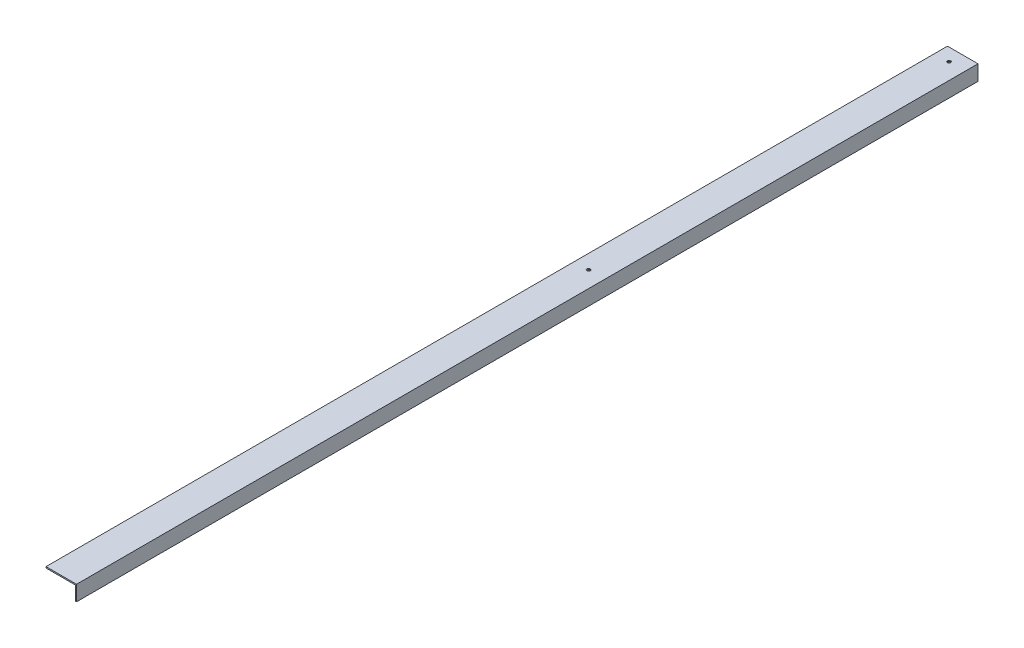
from build123d import *

# Parameters (mm, degrees)
EXTRUDE_THIN1_DEPTH            = 1125.4359
F_4_CLEARANCE_HOLE1_AT_2_COUNT = 2
F_4_CLEARANCE_HOLE1_AT_2_PITCH = 450


with BuildPart() as part:
    # Sketch1 → Extrude-Thin1 (new body)
    with BuildSketch(Plane.XY):
        Polygon((-38.1, 0), (0, 0), (0, -19.05), (-1.5748, -19.05), (-1.5748, -1.5748), (-38.1, -1.5748), align=None)
    extrude(amount=EXTRUDE_THIN1_DEPTH)

    # Sketch2 → 4 Clearance Hole1 (revolve, cut)
    with BuildSketch(Plane(origin=(-20.32, 0, 15.875), x_dir=(0, 0, 1), z_dir=(1, 0, 0))):
        Polygon((0, 0), (0, 1.5748), (2.1082, 1.5748), (1.4732, 0.9398), (1.4732, 0.635), (2.1082, 0), align=None)
    f_4_clearance_hole1 = revolve(axis=Axis((-20.32, 6.35, 15.875), (0, -1, 0)), mode=Mode.SUBTRACT)

    # 4 Clearance Hole1 at 2: 4 Clearance Hole1 ×2
    with Locations(*[(0, 0, i * F_4_CLEARANCE_HOLE1_AT_2_PITCH) for i in range(1, F_4_CLEARANCE_HOLE1_AT_2_COUNT)]):
        add(f_4_clearance_hole1, mode=Mode.SUBTRACT)


solid = part.part
